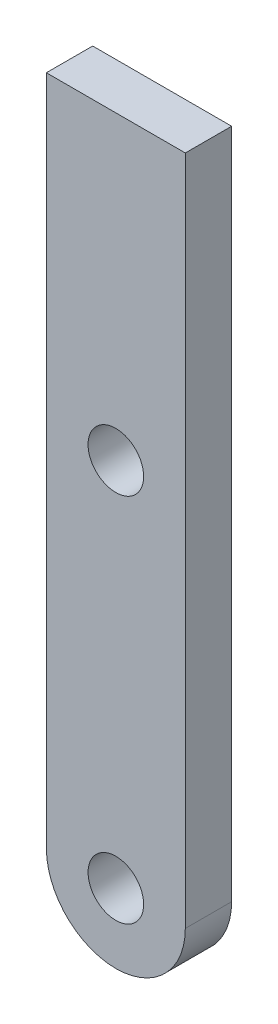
from build123d import *

# Parameters (mm, degrees)
EXTRUSION1_DEPTH        = 10
ESQUISSE2_R             = 6
ENL_V_MAT_EXTRU_1_DEPTH = 10


with BuildPart() as part:
    # Esquisse1 → Extrusion1 (new body)
    with BuildSketch(Plane.XY):
        with BuildLine():
            Line((0, 0), (30, 0))
            Line((30, 0), (30, -145))
            ThreePointArc((30, -145), (15, -160), (0, -145))
            Line((0, -145), (0, 0))
        make_face()
    extrude(amount=EXTRUSION1_DEPTH)

    # Esquisse2 → Enl_v. mat.-Extru.1 (cut)
    with BuildSketch(Plane.XY.offset(10)):
        with Locations((15, -145)):
            Circle(ESQUISSE2_R)
        with Locations((15, -65)):
            Circle(ESQUISSE2_R)
    extrude(amount=-ENL_V_MAT_EXTRU_1_DEPTH, mode=Mode.SUBTRACT)


solid = part.part
